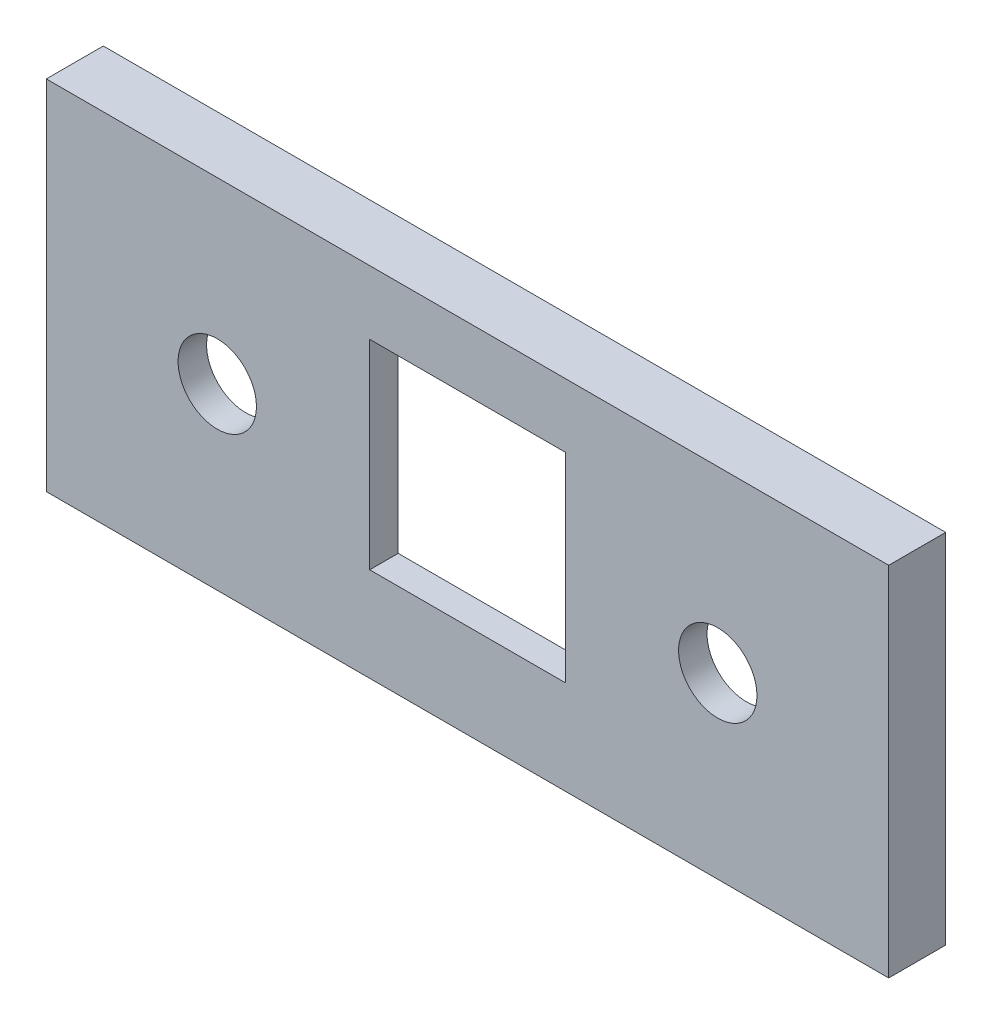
from build123d import *

# Parameters (mm, degrees)
ESQUISSE2_W             = 13.73
ESQUISSE2_H             = 14.01
BOSS_EXTRU_1_DEPTH      = 2
D_GAGEMENT_M51_D        = 5.5
BOSS_EXTRU_3_DEPTH      = 2
BOSS_EXTRU_3_DEPTH_BACK = 2
ESQUISSE7_W             = 59.131
ESQUISSE7_H             = 25.09


with BuildPart() as part:
    # Esquisse2 → Boss.-Extru.1 (new body)
    with BuildSketch(Plane.XY):
        with BuildLine():
            Line((3.002, 0), (52.129, 0))
            ThreePointArc((52.129, 0), (54.251734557, 0.879265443), (55.131, 3.002))
            Line((55.131, 3.002), (55.131, 18.088))
            ThreePointArc((55.131, 18.088), (54.251734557, 20.210734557), (52.129, 21.09))
            Line((52.129, 21.09), (3.002, 21.09))
            ThreePointArc((3.002, 21.09), (0.879265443, 20.210734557), (0, 18.088))
            Line((0, 18.088), (0, 3.002))
            ThreePointArc((0, 3.002), (0.879265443, 0.879265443), (3.002, 0))
        make_face()
        with Locations((27.5655, 11.603916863)):
            Rectangle(ESQUISSE2_W, ESQUISSE2_H, mode=Mode.SUBTRACT)
    extrude(amount=BOSS_EXTRU_1_DEPTH)

    # D_gagement M51 (through all)
    with Locations(Plane(origin=(10, 10.545, 2), x_dir=(1, 0, 0), z_dir=(0, 0, 1))):
        with Locations((0, 0)):
            d_gagement_m51 = Hole(D_GAGEMENT_M51_D / 2)

    # Sym_trie1: D_gagement M51 across plane
    add(d_gagement_m51.mirror(Plane.ZY.offset(-27.5655)), mode=Mode.SUBTRACT)

    # Esquisse7 → Boss.-Extru.3 (add, two sides: drawn at the far end of the back side and taken through both)
    with BuildSketch(Plane(origin=(0, 0, 0), x_dir=(-1, 0, 0), z_dir=(0, 0, -1)).offset(-BOSS_EXTRU_3_DEPTH_BACK)):
        with Locations((-27.5655, 10.545)):
            Rectangle(ESQUISSE7_W, ESQUISSE7_H)
        with BuildLine():
            Line((-3.002, 21.09), (-52.129, 21.09))
            ThreePointArc((-52.129, 21.09), (-54.251734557, 20.210734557), (-55.131, 18.088))
            Line((-55.131, 18.088), (-55.131, 3.002))
            ThreePointArc((-55.131, 3.002), (-54.251734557, 0.879265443), (-52.129, 0))
            Line((-52.129, 0), (-3.002, 0))
            ThreePointArc((-3.002, 0), (-0.879265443, 0.879265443), (0, 3.002))
            Line((0, 3.002), (0, 18.088))
            ThreePointArc((0, 18.088), (-0.879265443, 20.210734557), (-3.002, 21.09))
        make_face(mode=Mode.SUBTRACT)
    extrude(amount=BOSS_EXTRU_3_DEPTH + BOSS_EXTRU_3_DEPTH_BACK)


solid = part.part
